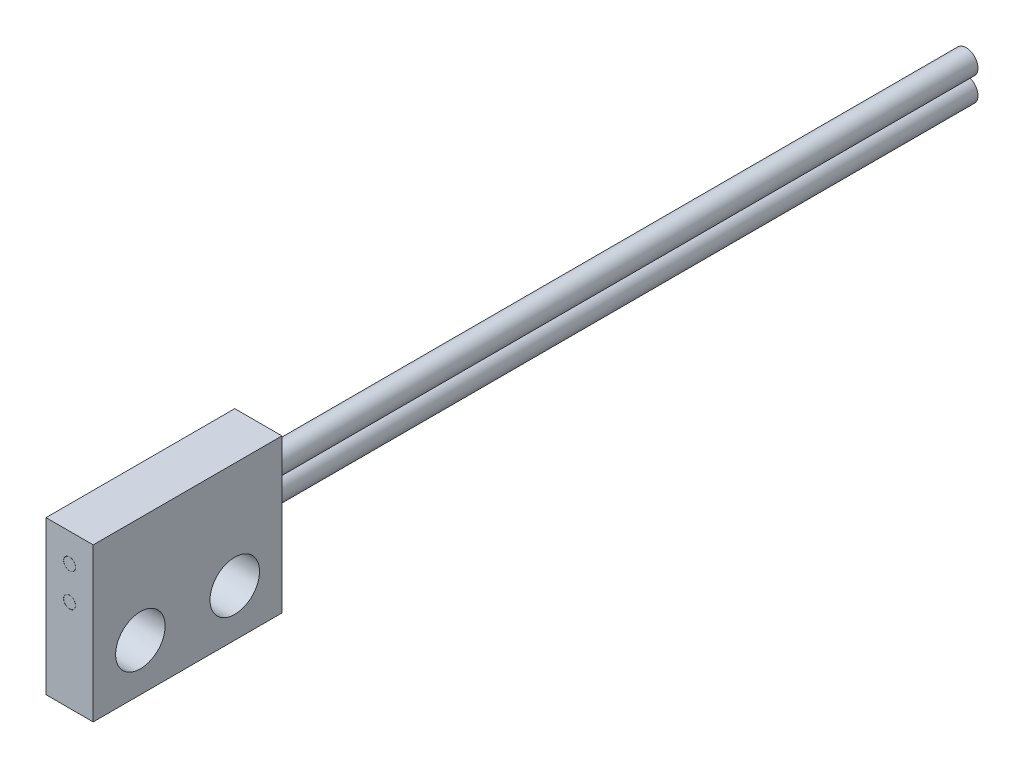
from build123d import *

# Parameters (mm, degrees)
SKETCH_1_W          = 8
SKETCH_1_H          = 6.5
EXTRUDE_1_DEPTH     = 1
SKETCH_2_R          = 1.05
CUT_EXTRUDE_1_DEPTH = 2
SKETCH_3_R          = 0.255
SKETCH_3_R_2        = 0.25
CUT_EXTRUDE_2_DEPTH = 0.1
SKETCH_4_R          = 0.5
EXTRUDE_2_DEPTH     = 30


with BuildPart() as part:
    # Sketch 1 → Extrude 1 (new, symmetric)
    with BuildSketch(Plane(origin=(0, 0, 0), x_dir=(0, 0, -1), z_dir=(1, 0, 0))):
        Rectangle(SKETCH_1_W, SKETCH_1_H)
    extrude(amount=EXTRUDE_1_DEPTH, both=True)

    # Sketch 2 → Cut-Extrude 1 (cut)
    with BuildSketch(Plane(origin=(1, 0, 0), x_dir=(0, 0, -1), z_dir=(1, 0, 0))):
        with Locations((-2, -1.25)):
            Circle(SKETCH_2_R)
        with Locations((2, -1.25)):
            Circle(SKETCH_2_R)
    extrude(amount=-CUT_EXTRUDE_1_DEPTH, mode=Mode.SUBTRACT)

    # Sketch 3 → Cut-Extrude 2 (cut)
    # profile 1 of 2: a face of its own
    with BuildSketch(Plane.XY.offset(4)):
        with Locations((0, 2.05)):
            Circle(SKETCH_3_R)
        with Locations((0, 2.05)):
            Circle(SKETCH_3_R_2, mode=Mode.SUBTRACT)
    # profile 2 of 2: a face of its own
    with BuildSketch(Plane.XY.offset(4)):
        with Locations((0, 0.65)):
            Circle(SKETCH_3_R)
        with Locations((0, 0.65)):
            Circle(SKETCH_3_R_2, mode=Mode.SUBTRACT)
    extrude(amount=-CUT_EXTRUDE_2_DEPTH, mode=Mode.SUBTRACT)

    # Sketch 4 → Extrude 2 (add)
    with BuildSketch(Plane(origin=(0, 0, -4), x_dir=(-1, 0, 0), z_dir=(0, 0, -1))):
        with Locations(Location((0, 1.5, 0), (0, 0, 270))):
            Circle(SKETCH_4_R)
        with Locations(Location((0, 0.49, 0), (0, 0, 270))):
            Circle(SKETCH_4_R)
    extrude(amount=EXTRUDE_2_DEPTH)


solid = part.part
